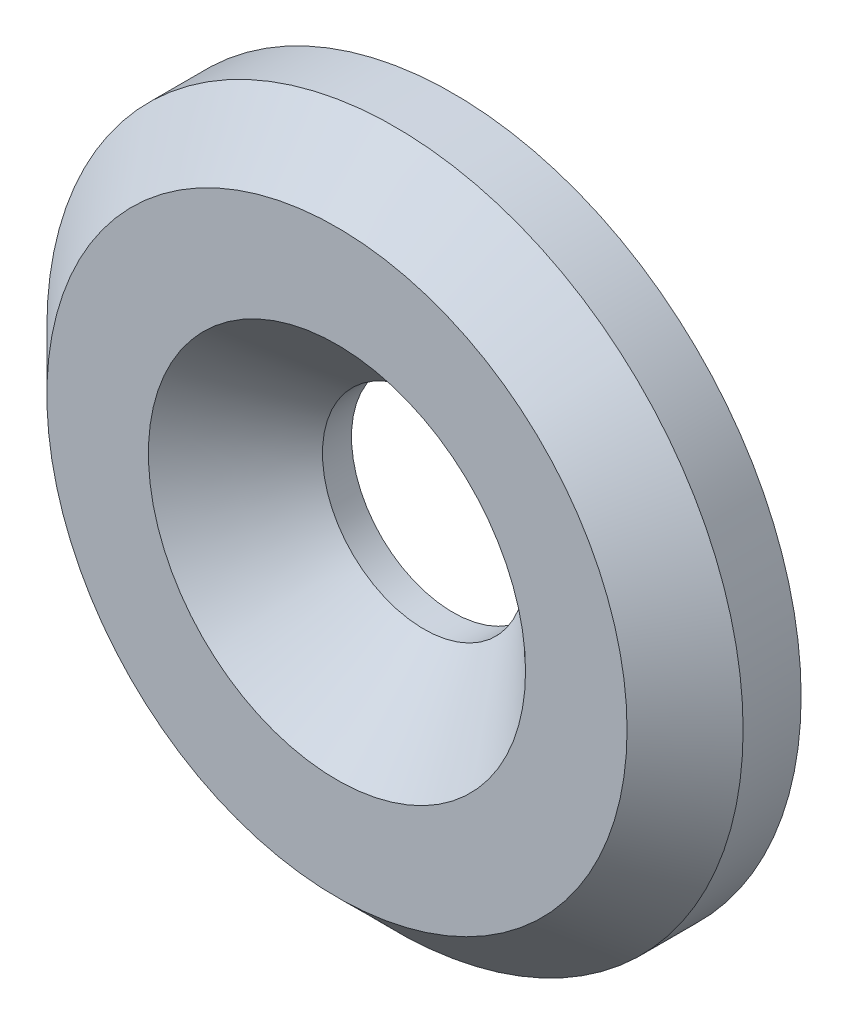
ISO-10303-21;
HEADER;
FILE_DESCRIPTION(('STEP AP214'),'2;1');
FILE_NAME('part.step','',(''),(''),'','','');
FILE_SCHEMA(('AUTOMOTIVE_DESIGN { 1 0 10303 214 1 1 1 1 }'));
ENDSEC;
DATA;
#1=APPLICATION_CONTEXT('core data for automotive mechanical design processes');
#2=APPLICATION_PROTOCOL_DEFINITION('international standard','automotive_design',2000,#1);
#3=PRODUCT_CONTEXT('',#1,'mechanical');
#4=PRODUCT('Part','Part','',(#3));
#5=PRODUCT_RELATED_PRODUCT_CATEGORY('part','',(#4));
#6=PRODUCT_DEFINITION_FORMATION('','',#4);
#7=PRODUCT_DEFINITION_CONTEXT('part definition',#1,'design');
#8=PRODUCT_DEFINITION('design','',#6,#7);
#9=PRODUCT_DEFINITION_SHAPE('','',#8);
#10=(LENGTH_UNIT() NAMED_UNIT(*) SI_UNIT(.MILLI.,.METRE.));
#11=(NAMED_UNIT(*) PLANE_ANGLE_UNIT() SI_UNIT($,.RADIAN.));
#12=(NAMED_UNIT(*) SI_UNIT($,.STERADIAN.) SOLID_ANGLE_UNIT());
#13=UNCERTAINTY_MEASURE_WITH_UNIT(LENGTH_MEASURE(1.E-05),#10,'distance_accuracy_value','');
#14=(GEOMETRIC_REPRESENTATION_CONTEXT(3) GLOBAL_UNCERTAINTY_ASSIGNED_CONTEXT((#13)) GLOBAL_UNIT_ASSIGNED_CONTEXT((#10,
#11,#12)) REPRESENTATION_CONTEXT('',''));
#15=CARTESIAN_POINT('',(0.,0.,0.));
#16=DIRECTION('',(0.,0.,1.));
#17=DIRECTION('',(1.,0.,0.));
#18=AXIS2_PLACEMENT_3D('',#15,#16,#17);
#19=CARTESIAN_POINT('',(0.,0.,2.));
#20=DIRECTION('',(0.,0.,1.));
#21=DIRECTION('',(1.,0.,0.));
#22=AXIS2_PLACEMENT_3D('',#19,#20,#21);
#23=PLANE('',#22);
#24=CARTESIAN_POINT('',(0.,0.,2.));
#25=DIRECTION('',(0.,0.,1.));
#26=DIRECTION('',(1.,0.,0.));
#27=AXIS2_PLACEMENT_3D('',#24,#25,#26);
#28=CIRCLE('',#27,3.25000000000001);
#29=CARTESIAN_POINT('',(3.25000000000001,0.,2.));
#30=VERTEX_POINT('',#29);
#31=EDGE_CURVE('E10',#30,#30,#28,.F.);
#32=ORIENTED_EDGE('',*,*,#31,.T.);
#33=EDGE_LOOP('',(#32));
#34=FACE_BOUND('',#33,.T.);
#35=CARTESIAN_POINT('',(0.,0.,2.));
#36=DIRECTION('',(0.,0.,1.));
#37=DIRECTION('',(1.,0.,0.));
#38=AXIS2_PLACEMENT_3D('',#35,#36,#37);
#39=CIRCLE('',#38,5.);
#40=CARTESIAN_POINT('',(5.,0.,2.));
#41=VERTEX_POINT('',#40);
#42=EDGE_CURVE('E48',#41,#41,#39,.T.);
#43=ORIENTED_EDGE('',*,*,#42,.T.);
#44=EDGE_LOOP('',(#43));
#45=FACE_BOUND('',#44,.T.);
#46=ADVANCED_FACE('F32',(#34,#45),#23,.T.);
#47=CARTESIAN_POINT('',(0.,0.,0.));
#48=DIRECTION('',(0.,0.,1.));
#49=DIRECTION('',(1.,0.,0.));
#50=AXIS2_PLACEMENT_3D('',#47,#48,#49);
#51=PLANE('',#50);
#52=CARTESIAN_POINT('',(0.,0.,0.));
#53=DIRECTION('',(0.,0.,1.));
#54=DIRECTION('',(1.,0.,0.));
#55=AXIS2_PLACEMENT_3D('',#52,#53,#54);
#56=CIRCLE('',#55,6.);
#57=CARTESIAN_POINT('',(6.,0.,0.));
#58=VERTEX_POINT('',#57);
#59=EDGE_CURVE('E53',#58,#58,#56,.T.);
#60=ORIENTED_EDGE('',*,*,#59,.F.);
#61=EDGE_LOOP('',(#60));
#62=FACE_BOUND('',#61,.T.);
#63=CARTESIAN_POINT('',(0.,0.,0.));
#64=DIRECTION('',(0.,0.,1.));
#65=DIRECTION('',(1.,0.,0.));
#66=AXIS2_PLACEMENT_3D('',#63,#64,#65);
#67=CIRCLE('',#66,1.75);
#68=CARTESIAN_POINT('',(1.75,0.,0.));
#69=VERTEX_POINT('',#68);
#70=EDGE_CURVE('E56',#69,#69,#67,.T.);
#71=ORIENTED_EDGE('',*,*,#70,.T.);
#72=EDGE_LOOP('',(#71));
#73=FACE_BOUND('',#72,.T.);
#74=ADVANCED_FACE('F60',(#62,#73),#51,.F.);
#75=CARTESIAN_POINT('',(0.,0.,2.));
#76=DIRECTION('',(0.,0.,-1.));
#77=DIRECTION('',(-1.,0.,0.));
#78=AXIS2_PLACEMENT_3D('',#75,#76,#77);
#79=CYLINDRICAL_SURFACE('',#78,6.);
#80=CARTESIAN_POINT('',(0.,0.,0.999999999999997));
#81=DIRECTION('',(0.,0.,1.));
#82=DIRECTION('',(1.,0.,0.));
#83=AXIS2_PLACEMENT_3D('',#80,#81,#82);
#84=CIRCLE('',#83,6.);
#85=CARTESIAN_POINT('',(6.,0.,0.999999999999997));
#86=VERTEX_POINT('',#85);
#87=EDGE_CURVE('E44',#86,#86,#84,.F.);
#88=ORIENTED_EDGE('',*,*,#87,.T.);
#89=EDGE_LOOP('',(#88));
#90=FACE_BOUND('',#89,.T.);
#91=ORIENTED_EDGE('',*,*,#59,.T.);
#92=EDGE_LOOP('',(#91));
#93=FACE_BOUND('',#92,.T.);
#94=ADVANCED_FACE('F65',(#90,#93),#79,.T.);
#95=CARTESIAN_POINT('',(0.,0.,2.));
#96=DIRECTION('',(0.,0.,-1.));
#97=DIRECTION('',(-1.,0.,0.));
#98=AXIS2_PLACEMENT_3D('',#95,#96,#97);
#99=CYLINDRICAL_SURFACE('',#98,1.75);
#100=CARTESIAN_POINT('',(0.,0.,0.499999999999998));
#101=DIRECTION('',(0.,0.,1.));
#102=DIRECTION('',(1.,0.,0.));
#103=AXIS2_PLACEMENT_3D('',#100,#101,#102);
#104=CIRCLE('',#103,1.75);
#105=CARTESIAN_POINT('',(1.75,0.,0.499999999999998));
#106=VERTEX_POINT('',#105);
#107=EDGE_CURVE('E40',#106,#106,#104,.T.);
#108=ORIENTED_EDGE('',*,*,#107,.T.);
#109=EDGE_LOOP('',(#108));
#110=FACE_BOUND('',#109,.T.);
#111=ORIENTED_EDGE('',*,*,#70,.F.);
#112=EDGE_LOOP('',(#111));
#113=FACE_BOUND('',#112,.T.);
#114=ADVANCED_FACE('F62',(#110,#113),#99,.F.);
#115=CARTESIAN_POINT('',(0.,0.,2.));
#116=DIRECTION('',(0.,0.,-1.));
#117=DIRECTION('',(-1.,0.,0.));
#118=AXIS2_PLACEMENT_3D('',#115,#116,#117);
#119=CONICAL_SURFACE('',#118,5.,0.785398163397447);
#120=ORIENTED_EDGE('',*,*,#87,.F.);
#121=EDGE_LOOP('',(#120));
#122=FACE_BOUND('',#121,.T.);
#123=ORIENTED_EDGE('',*,*,#42,.F.);
#124=EDGE_LOOP('',(#123));
#125=FACE_BOUND('',#124,.T.);
#126=ADVANCED_FACE('F64',(#122,#125),#119,.T.);
#127=CARTESIAN_POINT('',(0.,0.,0.499999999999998));
#128=DIRECTION('',(0.,0.,1.));
#129=DIRECTION('',(1.,0.,0.));
#130=AXIS2_PLACEMENT_3D('',#127,#128,#129);
#131=CONICAL_SURFACE('',#130,1.75,0.78539816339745);
#132=ORIENTED_EDGE('',*,*,#31,.F.);
#133=EDGE_LOOP('',(#132));
#134=FACE_BOUND('',#133,.T.);
#135=ORIENTED_EDGE('',*,*,#107,.F.);
#136=EDGE_LOOP('',(#135));
#137=FACE_BOUND('',#136,.T.);
#138=ADVANCED_FACE('F35',(#134,#137),#131,.F.);
#139=CLOSED_SHELL('',(#46,#74,#94,#114,#126,#138));
#140=MANIFOLD_SOLID_BREP('B2',#139);
#141=ADVANCED_BREP_SHAPE_REPRESENTATION('',(#18,#140),#14);
#142=SHAPE_DEFINITION_REPRESENTATION(#9,#141);
ENDSEC;
END-ISO-10303-21;
